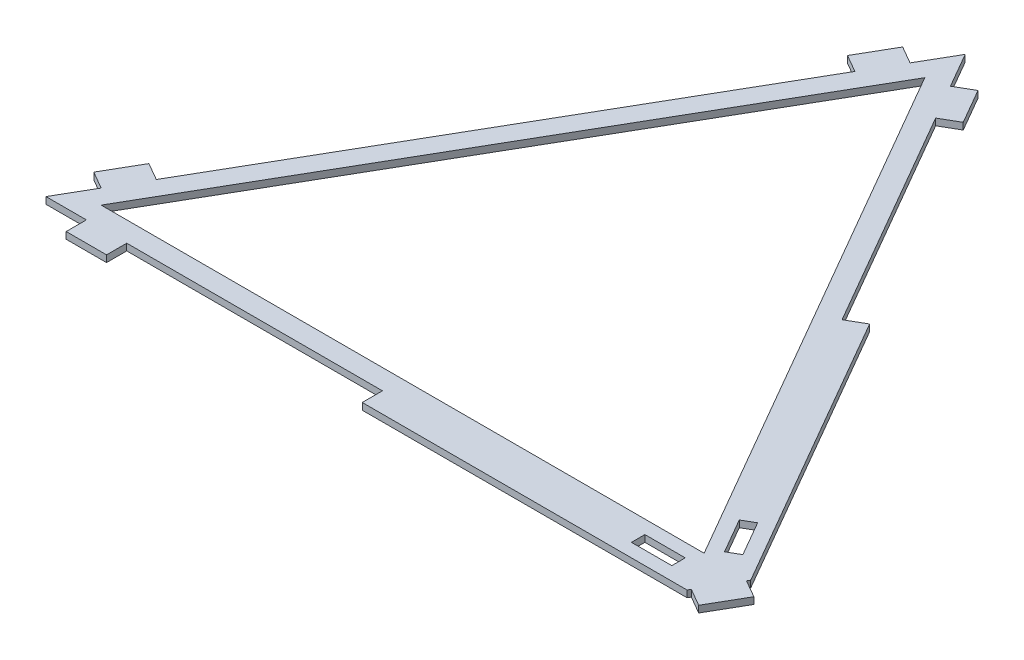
ISO-10303-21;
HEADER;
FILE_DESCRIPTION(('STEP AP214'),'2;1');
FILE_NAME('part.step','',(''),(''),'','','');
FILE_SCHEMA(('AUTOMOTIVE_DESIGN { 1 0 10303 214 1 1 1 1 }'));
ENDSEC;
DATA;
#1=APPLICATION_CONTEXT('core data for automotive mechanical design processes');
#2=APPLICATION_PROTOCOL_DEFINITION('international standard','automotive_design',2000,#1);
#3=PRODUCT_CONTEXT('',#1,'mechanical');
#4=PRODUCT('Part','Part','',(#3));
#5=PRODUCT_RELATED_PRODUCT_CATEGORY('part','',(#4));
#6=PRODUCT_DEFINITION_FORMATION('','',#4);
#7=PRODUCT_DEFINITION_CONTEXT('part definition',#1,'design');
#8=PRODUCT_DEFINITION('design','',#6,#7);
#9=PRODUCT_DEFINITION_SHAPE('','',#8);
#10=(LENGTH_UNIT() NAMED_UNIT(*) SI_UNIT(.MILLI.,.METRE.));
#11=(NAMED_UNIT(*) PLANE_ANGLE_UNIT() SI_UNIT($,.RADIAN.));
#12=(NAMED_UNIT(*) SI_UNIT($,.STERADIAN.) SOLID_ANGLE_UNIT());
#13=UNCERTAINTY_MEASURE_WITH_UNIT(LENGTH_MEASURE(1.E-05),#10,'distance_accuracy_value','');
#14=(GEOMETRIC_REPRESENTATION_CONTEXT(3) GLOBAL_UNCERTAINTY_ASSIGNED_CONTEXT((#13)) GLOBAL_UNIT_ASSIGNED_CONTEXT((#10,
#11,#12)) REPRESENTATION_CONTEXT('',''));
#15=CARTESIAN_POINT('',(0.,0.,0.));
#16=DIRECTION('',(0.,0.,1.));
#17=DIRECTION('',(1.,0.,0.));
#18=AXIS2_PLACEMENT_3D('',#15,#16,#17);
#19=CARTESIAN_POINT('',(0.,5.,-5.00000000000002));
#20=DIRECTION('',(0.,0.,-1.));
#21=DIRECTION('',(-1.,0.,0.));
#22=AXIS2_PLACEMENT_3D('',#19,#20,#21);
#23=PLANE('',#22);
#24=DIRECTION('',(1.,0.,0.));
#25=VECTOR('',#24,1.);
#26=CARTESIAN_POINT('',(0.,0.,-5.00000000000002));
#27=LINE('',#26,#25);
#28=CARTESIAN_POINT('',(440.,0.,-5.00000000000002));
#29=VERTEX_POINT('',#28);
#30=CARTESIAN_POINT('',(470.,0.,-5.00000000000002));
#31=VERTEX_POINT('',#30);
#32=EDGE_CURVE('E416',#29,#31,#27,.T.);
#33=ORIENTED_EDGE('',*,*,#32,.T.);
#34=DIRECTION('',(0.,-1.,0.));
#35=VECTOR('',#34,1.);
#36=CARTESIAN_POINT('',(470.,5.,-5.00000000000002));
#37=LINE('',#36,#35);
#38=CARTESIAN_POINT('',(470.,5.,-5.00000000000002));
#39=VERTEX_POINT('',#38);
#40=EDGE_CURVE('E11',#39,#31,#37,.T.);
#41=ORIENTED_EDGE('',*,*,#40,.F.);
#42=DIRECTION('',(1.,0.,0.));
#43=VECTOR('',#42,1.);
#44=CARTESIAN_POINT('',(0.,5.,-5.00000000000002));
#45=LINE('',#44,#43);
#46=CARTESIAN_POINT('',(440.,5.,-5.00000000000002));
#47=VERTEX_POINT('',#46);
#48=EDGE_CURVE('E300',#47,#39,#45,.T.);
#49=ORIENTED_EDGE('',*,*,#48,.F.);
#50=DIRECTION('',(0.,-1.,0.));
#51=VECTOR('',#50,1.);
#52=CARTESIAN_POINT('',(440.,5.,-5.00000000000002));
#53=LINE('',#52,#51);
#54=EDGE_CURVE('E54',#47,#29,#53,.T.);
#55=ORIENTED_EDGE('',*,*,#54,.T.);
#56=EDGE_LOOP('',(#33,#41,#49,#55));
#57=FACE_BOUND('',#56,.T.);
#58=ADVANCED_FACE('F35',(#57),#23,.F.);
#59=CARTESIAN_POINT('',(470.,5.,0.));
#60=DIRECTION('',(1.,0.,0.));
#61=DIRECTION('',(0.,0.,-1.));
#62=AXIS2_PLACEMENT_3D('',#59,#60,#61);
#63=PLANE('',#62);
#64=DIRECTION('',(0.,0.,1.));
#65=VECTOR('',#64,1.);
#66=CARTESIAN_POINT('',(470.,0.,0.));
#67=LINE('',#66,#65);
#68=CARTESIAN_POINT('',(470.,0.,4.99999999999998));
#69=VERTEX_POINT('',#68);
#70=EDGE_CURVE('E306',#31,#69,#67,.T.);
#71=ORIENTED_EDGE('',*,*,#70,.T.);
#72=DIRECTION('',(0.,-1.,0.));
#73=VECTOR('',#72,1.);
#74=CARTESIAN_POINT('',(470.,5.,4.99999999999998));
#75=LINE('',#74,#73);
#76=CARTESIAN_POINT('',(470.,5.,4.99999999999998));
#77=VERTEX_POINT('',#76);
#78=EDGE_CURVE('E45',#77,#69,#75,.T.);
#79=ORIENTED_EDGE('',*,*,#78,.F.);
#80=DIRECTION('',(0.,0.,1.));
#81=VECTOR('',#80,1.);
#82=CARTESIAN_POINT('',(470.,5.,0.));
#83=LINE('',#82,#81);
#84=EDGE_CURVE('E294',#39,#77,#83,.T.);
#85=ORIENTED_EDGE('',*,*,#84,.F.);
#86=ORIENTED_EDGE('',*,*,#40,.T.);
#87=EDGE_LOOP('',(#71,#79,#85,#86));
#88=FACE_BOUND('',#87,.T.);
#89=ADVANCED_FACE('F305',(#88),#63,.F.);
#90=CARTESIAN_POINT('',(0.,5.,4.99999999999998));
#91=DIRECTION('',(0.,0.,-1.));
#92=DIRECTION('',(-1.,0.,0.));
#93=AXIS2_PLACEMENT_3D('',#90,#91,#92);
#94=PLANE('',#93);
#95=DIRECTION('',(1.,0.,0.));
#96=VECTOR('',#95,1.);
#97=CARTESIAN_POINT('',(0.,0.,4.99999999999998));
#98=LINE('',#97,#96);
#99=CARTESIAN_POINT('',(440.,0.,4.99999999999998));
#100=VERTEX_POINT('',#99);
#101=EDGE_CURVE('E419',#100,#69,#98,.T.);
#102=ORIENTED_EDGE('',*,*,#101,.F.);
#103=DIRECTION('',(0.,-1.,0.));
#104=VECTOR('',#103,1.);
#105=CARTESIAN_POINT('',(440.,5.,4.99999999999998));
#106=LINE('',#105,#104);
#107=CARTESIAN_POINT('',(440.,5.,4.99999999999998));
#108=VERTEX_POINT('',#107);
#109=EDGE_CURVE('E173',#108,#100,#106,.T.);
#110=ORIENTED_EDGE('',*,*,#109,.F.);
#111=DIRECTION('',(1.,0.,0.));
#112=VECTOR('',#111,1.);
#113=CARTESIAN_POINT('',(0.,5.,4.99999999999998));
#114=LINE('',#113,#112);
#115=EDGE_CURVE('E299',#108,#77,#114,.T.);
#116=ORIENTED_EDGE('',*,*,#115,.T.);
#117=ORIENTED_EDGE('',*,*,#78,.T.);
#118=EDGE_LOOP('',(#102,#110,#116,#117));
#119=FACE_BOUND('',#118,.T.);
#120=ADVANCED_FACE('F310',(#119),#94,.T.);
#121=CARTESIAN_POINT('',(12.9903810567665,5.,7.49999999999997));
#122=DIRECTION('',(0.866025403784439,0.,0.5));
#123=DIRECTION('',(0.5,0.,-0.866025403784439));
#124=AXIS2_PLACEMENT_3D('',#121,#122,#123);
#125=PLANE('',#124);
#126=DIRECTION('',(-0.5,0.,0.866025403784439));
#127=VECTOR('',#126,1.);
#128=CARTESIAN_POINT('',(12.9903810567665,0.,7.49999999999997));
#129=LINE('',#128,#127);
#130=CARTESIAN_POINT('',(250.,0.,-403.012701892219));
#131=VERTEX_POINT('',#130);
#132=CARTESIAN_POINT('',(25.9807621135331,0.,-15.));
#133=VERTEX_POINT('',#132);
#134=EDGE_CURVE('E407',#131,#133,#129,.T.);
#135=ORIENTED_EDGE('',*,*,#134,.F.);
#136=DIRECTION('',(0.,-1.,0.));
#137=VECTOR('',#136,1.);
#138=CARTESIAN_POINT('',(250.,5.,-403.012701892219));
#139=LINE('',#138,#137);
#140=CARTESIAN_POINT('',(250.,5.,-403.012701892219));
#141=VERTEX_POINT('',#140);
#142=EDGE_CURVE('E426',#141,#131,#139,.T.);
#143=ORIENTED_EDGE('',*,*,#142,.F.);
#144=DIRECTION('',(-0.5,0.,0.866025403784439));
#145=VECTOR('',#144,1.);
#146=CARTESIAN_POINT('',(12.9903810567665,5.,7.49999999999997));
#147=LINE('',#146,#145);
#148=CARTESIAN_POINT('',(25.9807621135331,5.,-15.));
#149=VERTEX_POINT('',#148);
#150=EDGE_CURVE('E600',#141,#149,#147,.T.);
#151=ORIENTED_EDGE('',*,*,#150,.T.);
#152=DIRECTION('',(0.,-1.,0.));
#153=VECTOR('',#152,1.);
#154=CARTESIAN_POINT('',(25.9807621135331,5.,-15.));
#155=LINE('',#154,#153);
#156=EDGE_CURVE('E428',#149,#133,#155,.T.);
#157=ORIENTED_EDGE('',*,*,#156,.T.);
#158=EDGE_LOOP('',(#135,#143,#151,#157));
#159=FACE_BOUND('',#158,.T.);
#160=ADVANCED_FACE('F622',(#159),#125,.T.);
#161=CARTESIAN_POINT('',(362.009618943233,5.,-209.00635094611));
#162=DIRECTION('',(-0.866025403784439,0.,0.5));
#163=DIRECTION('',(0.5,0.,0.866025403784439));
#164=AXIS2_PLACEMENT_3D('',#161,#162,#163);
#165=PLANE('',#164);
#166=DIRECTION('',(-0.5,0.,-0.866025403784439));
#167=VECTOR('',#166,1.);
#168=CARTESIAN_POINT('',(362.009618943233,0.,-209.00635094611));
#169=LINE('',#168,#167);
#170=CARTESIAN_POINT('',(474.019237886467,0.,-15.));
#171=VERTEX_POINT('',#170);
#172=EDGE_CURVE('E410',#171,#131,#169,.T.);
#173=ORIENTED_EDGE('',*,*,#172,.F.);
#174=DIRECTION('',(0.,-1.,0.));
#175=VECTOR('',#174,1.);
#176=CARTESIAN_POINT('',(474.019237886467,5.,-15.));
#177=LINE('',#176,#175);
#178=CARTESIAN_POINT('',(474.019237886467,5.,-15.));
#179=VERTEX_POINT('',#178);
#180=EDGE_CURVE('E430',#179,#171,#177,.T.);
#181=ORIENTED_EDGE('',*,*,#180,.F.);
#182=DIRECTION('',(-0.5,0.,-0.866025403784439));
#183=VECTOR('',#182,1.);
#184=CARTESIAN_POINT('',(362.009618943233,5.,-209.00635094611));
#185=LINE('',#184,#183);
#186=EDGE_CURVE('E603',#179,#141,#185,.T.);
#187=ORIENTED_EDGE('',*,*,#186,.T.);
#188=ORIENTED_EDGE('',*,*,#142,.T.);
#189=EDGE_LOOP('',(#173,#181,#187,#188));
#190=FACE_BOUND('',#189,.T.);
#191=ADVANCED_FACE('F617',(#190),#165,.T.);
#192=CARTESIAN_POINT('',(370.669872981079,5.,-214.006350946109));
#193=DIRECTION('',(0.86602540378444,0.,-0.499999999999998));
#194=DIRECTION('',(-0.499999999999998,0.,-0.86602540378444));
#195=AXIS2_PLACEMENT_3D('',#192,#193,#194);
#196=PLANE('',#195);
#197=DIRECTION('',(0.499999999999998,0.,0.86602540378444));
#198=VECTOR('',#197,1.);
#199=CARTESIAN_POINT('',(370.669872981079,0.,-214.006350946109));
#200=LINE('',#199,#198);
#201=CARTESIAN_POINT('',(465.669872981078,0.,-49.4615242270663));
#202=VERTEX_POINT('',#201);
#203=CARTESIAN_POINT('',(480.669872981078,0.,-23.4807621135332));
#204=VERTEX_POINT('',#203);
#205=EDGE_CURVE('E395',#202,#204,#200,.T.);
#206=ORIENTED_EDGE('',*,*,#205,.F.);
#207=DIRECTION('',(0.,-1.,0.));
#208=VECTOR('',#207,1.);
#209=CARTESIAN_POINT('',(465.669872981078,5.,-49.4615242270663));
#210=LINE('',#209,#208);
#211=CARTESIAN_POINT('',(465.669872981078,5.,-49.4615242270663));
#212=VERTEX_POINT('',#211);
#213=EDGE_CURVE('E431',#212,#202,#210,.T.);
#214=ORIENTED_EDGE('',*,*,#213,.F.);
#215=DIRECTION('',(0.499999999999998,0.,0.86602540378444));
#216=VECTOR('',#215,1.);
#217=CARTESIAN_POINT('',(370.669872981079,5.,-214.006350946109));
#218=LINE('',#217,#216);
#219=CARTESIAN_POINT('',(480.669872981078,5.,-23.4807621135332));
#220=VERTEX_POINT('',#219);
#221=EDGE_CURVE('E589',#212,#220,#218,.T.);
#222=ORIENTED_EDGE('',*,*,#221,.T.);
#223=DIRECTION('',(0.,-1.,0.));
#224=VECTOR('',#223,1.);
#225=CARTESIAN_POINT('',(480.669872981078,5.,-23.4807621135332));
#226=LINE('',#225,#224);
#227=EDGE_CURVE('E434',#220,#204,#226,.T.);
#228=ORIENTED_EDGE('',*,*,#227,.T.);
#229=EDGE_LOOP('',(#206,#214,#222,#228));
#230=FACE_BOUND('',#229,.T.);
#231=ADVANCED_FACE('F629',(#230),#196,.T.);
#232=CARTESIAN_POINT('',(95.,5.,164.544826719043));
#233=DIRECTION('',(-0.5,0.,-0.866025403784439));
#234=DIRECTION('',(-0.866025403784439,0.,0.5));
#235=AXIS2_PLACEMENT_3D('',#232,#233,#234);
#236=PLANE('',#235);
#237=DIRECTION('',(0.866025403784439,0.,-0.5));
#238=VECTOR('',#237,1.);
#239=CARTESIAN_POINT('',(95.,0.,164.544826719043));
#240=LINE('',#239,#238);
#241=CARTESIAN_POINT('',(474.330127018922,0.,-54.4615242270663));
#242=VERTEX_POINT('',#241);
#243=EDGE_CURVE('E398',#202,#242,#240,.T.);
#244=ORIENTED_EDGE('',*,*,#243,.T.);
#245=DIRECTION('',(0.,-1.,0.));
#246=VECTOR('',#245,1.);
#247=CARTESIAN_POINT('',(474.330127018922,5.,-54.4615242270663));
#248=LINE('',#247,#246);
#249=CARTESIAN_POINT('',(474.330127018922,5.,-54.4615242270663));
#250=VERTEX_POINT('',#249);
#251=EDGE_CURVE('E438',#250,#242,#248,.T.);
#252=ORIENTED_EDGE('',*,*,#251,.F.);
#253=DIRECTION('',(0.866025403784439,0.,-0.5));
#254=VECTOR('',#253,1.);
#255=CARTESIAN_POINT('',(95.,5.,164.544826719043));
#256=LINE('',#255,#254);
#257=EDGE_CURVE('E592',#212,#250,#256,.T.);
#258=ORIENTED_EDGE('',*,*,#257,.F.);
#259=ORIENTED_EDGE('',*,*,#213,.T.);
#260=EDGE_LOOP('',(#244,#252,#258,#259));
#261=FACE_BOUND('',#260,.T.);
#262=ADVANCED_FACE('F755',(#261),#236,.F.);
#263=CARTESIAN_POINT('',(379.330127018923,5.,-219.006350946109));
#264=DIRECTION('',(0.86602540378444,0.,-0.499999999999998));
#265=DIRECTION('',(-0.499999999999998,0.,-0.86602540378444));
#266=AXIS2_PLACEMENT_3D('',#263,#264,#265);
#267=PLANE('',#266);
#268=DIRECTION('',(0.499999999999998,0.,0.86602540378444));
#269=VECTOR('',#268,1.);
#270=CARTESIAN_POINT('',(379.330127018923,0.,-219.006350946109));
#271=LINE('',#270,#269);
#272=CARTESIAN_POINT('',(489.330127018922,0.,-28.4807621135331));
#273=VERTEX_POINT('',#272);
#274=EDGE_CURVE('E401',#242,#273,#271,.T.);
#275=ORIENTED_EDGE('',*,*,#274,.T.);
#276=DIRECTION('',(0.,-1.,0.));
#277=VECTOR('',#276,1.);
#278=CARTESIAN_POINT('',(489.330127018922,5.,-28.4807621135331));
#279=LINE('',#278,#277);
#280=CARTESIAN_POINT('',(489.330127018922,5.,-28.4807621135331));
#281=VERTEX_POINT('',#280);
#282=EDGE_CURVE('E436',#281,#273,#279,.T.);
#283=ORIENTED_EDGE('',*,*,#282,.F.);
#284=DIRECTION('',(0.499999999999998,0.,0.86602540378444));
#285=VECTOR('',#284,1.);
#286=CARTESIAN_POINT('',(379.330127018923,5.,-219.006350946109));
#287=LINE('',#286,#285);
#288=EDGE_CURVE('E595',#250,#281,#287,.T.);
#289=ORIENTED_EDGE('',*,*,#288,.F.);
#290=ORIENTED_EDGE('',*,*,#251,.T.);
#291=EDGE_LOOP('',(#275,#283,#289,#290));
#292=FACE_BOUND('',#291,.T.);
#293=ADVANCED_FACE('F751',(#292),#267,.F.);
#294=CARTESIAN_POINT('',(375.000000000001,5.,216.506350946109));
#295=DIRECTION('',(0.86602540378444,0.,0.499999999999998));
#296=DIRECTION('',(0.499999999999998,0.,-0.86602540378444));
#297=AXIS2_PLACEMENT_3D('',#294,#295,#296);
#298=PLANE('',#297);
#299=DIRECTION('',(-0.499999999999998,0.,0.86602540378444));
#300=VECTOR('',#299,1.);
#301=CARTESIAN_POINT('',(375.000000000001,0.,216.506350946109));
#302=LINE('',#301,#300);
#303=CARTESIAN_POINT('',(492.5,0.,12.9903810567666));
#304=VERTEX_POINT('',#303);
#305=CARTESIAN_POINT('',(491.339745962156,0.,15.));
#306=VERTEX_POINT('',#305);
#307=EDGE_CURVE('E317',#304,#306,#302,.T.);
#308=ORIENTED_EDGE('',*,*,#307,.F.);
#309=DIRECTION('',(0.,-1.,0.));
#310=VECTOR('',#309,1.);
#311=CARTESIAN_POINT('',(492.5,5.,12.9903810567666));
#312=LINE('',#311,#310);
#313=CARTESIAN_POINT('',(492.5,5.,12.9903810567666));
#314=VERTEX_POINT('',#313);
#315=EDGE_CURVE('E39',#314,#304,#312,.T.);
#316=ORIENTED_EDGE('',*,*,#315,.F.);
#317=DIRECTION('',(-0.499999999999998,0.,0.86602540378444));
#318=VECTOR('',#317,1.);
#319=CARTESIAN_POINT('',(375.000000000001,5.,216.506350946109));
#320=LINE('',#319,#318);
#321=CARTESIAN_POINT('',(491.339745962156,5.,15.));
#322=VERTEX_POINT('',#321);
#323=EDGE_CURVE('E424',#314,#322,#320,.T.);
#324=ORIENTED_EDGE('',*,*,#323,.T.);
#325=DIRECTION('',(0.,-1.,0.));
#326=VECTOR('',#325,1.);
#327=CARTESIAN_POINT('',(491.339745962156,5.,15.));
#328=LINE('',#327,#326);
#329=EDGE_CURVE('E313',#322,#306,#328,.T.);
#330=ORIENTED_EDGE('',*,*,#329,.T.);
#331=EDGE_LOOP('',(#308,#316,#324,#330));
#332=FACE_BOUND('',#331,.T.);
#333=ADVANCED_FACE('F37',(#332),#298,.T.);
#334=CARTESIAN_POINT('',(117.5,5.,-203.515969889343));
#335=DIRECTION('',(-0.5,0.,0.866025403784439));
#336=DIRECTION('',(0.866025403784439,0.,0.5));
#337=AXIS2_PLACEMENT_3D('',#334,#335,#336);
#338=PLANE('',#337);
#339=DIRECTION('',(-0.866025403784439,0.,-0.5));
#340=VECTOR('',#339,1.);
#341=CARTESIAN_POINT('',(117.5,0.,-203.515969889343));
#342=LINE('',#341,#340);
#343=CARTESIAN_POINT('',(505.490381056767,0.,20.4903810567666));
#344=VERTEX_POINT('',#343);
#345=EDGE_CURVE('E320',#344,#304,#342,.T.);
#346=ORIENTED_EDGE('',*,*,#345,.F.);
#347=DIRECTION('',(0.,-1.,0.));
#348=VECTOR('',#347,1.);
#349=CARTESIAN_POINT('',(505.490381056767,5.,20.4903810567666));
#350=LINE('',#349,#348);
#351=CARTESIAN_POINT('',(505.490381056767,5.,20.4903810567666));
#352=VERTEX_POINT('',#351);
#353=EDGE_CURVE('E498',#352,#344,#350,.T.);
#354=ORIENTED_EDGE('',*,*,#353,.F.);
#355=DIRECTION('',(-0.866025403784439,0.,-0.5));
#356=VECTOR('',#355,1.);
#357=CARTESIAN_POINT('',(117.5,5.,-203.515969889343));
#358=LINE('',#357,#356);
#359=EDGE_CURVE('E507',#352,#314,#358,.T.);
#360=ORIENTED_EDGE('',*,*,#359,.T.);
#361=ORIENTED_EDGE('',*,*,#315,.T.);
#362=EDGE_LOOP('',(#346,#354,#360,#361));
#363=FACE_BOUND('',#362,.T.);
#364=ADVANCED_FACE('F505',(#363),#338,.T.);
#365=CARTESIAN_POINT('',(387.990381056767,5.,224.00635094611));
#366=DIRECTION('',(0.866025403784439,0.,0.5));
#367=DIRECTION('',(0.5,0.,-0.866025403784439));
#368=AXIS2_PLACEMENT_3D('',#365,#366,#367);
#369=PLANE('',#368);
#370=DIRECTION('',(-0.5,0.,0.866025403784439));
#371=VECTOR('',#370,1.);
#372=CARTESIAN_POINT('',(387.990381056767,0.,224.00635094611));
#373=LINE('',#372,#371);
#374=CARTESIAN_POINT('',(520.490381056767,0.,-5.4903810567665));
#375=VERTEX_POINT('',#374);
#376=EDGE_CURVE('E323',#375,#344,#373,.T.);
#377=ORIENTED_EDGE('',*,*,#376,.F.);
#378=DIRECTION('',(0.,-1.,0.));
#379=VECTOR('',#378,1.);
#380=CARTESIAN_POINT('',(520.490381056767,5.,-5.4903810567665));
#381=LINE('',#380,#379);
#382=CARTESIAN_POINT('',(520.490381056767,5.,-5.4903810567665));
#383=VERTEX_POINT('',#382);
#384=EDGE_CURVE('E497',#383,#375,#381,.T.);
#385=ORIENTED_EDGE('',*,*,#384,.F.);
#386=DIRECTION('',(-0.5,0.,0.866025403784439));
#387=VECTOR('',#386,1.);
#388=CARTESIAN_POINT('',(387.990381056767,5.,224.00635094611));
#389=LINE('',#388,#387);
#390=EDGE_CURVE('E515',#383,#352,#389,.T.);
#391=ORIENTED_EDGE('',*,*,#390,.T.);
#392=ORIENTED_EDGE('',*,*,#353,.T.);
#393=EDGE_LOOP('',(#377,#385,#391,#392));
#394=FACE_BOUND('',#393,.T.);
#395=ADVANCED_FACE('F513',(#394),#369,.T.);
#396=CARTESIAN_POINT('',(132.499999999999,5.,-229.496732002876));
#397=DIRECTION('',(0.499999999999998,0.,-0.86602540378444));
#398=DIRECTION('',(-0.86602540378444,0.,-0.499999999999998));
#399=AXIS2_PLACEMENT_3D('',#396,#397,#398);
#400=PLANE('',#399);
#401=DIRECTION('',(0.86602540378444,0.,0.499999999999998));
#402=VECTOR('',#401,1.);
#403=CARTESIAN_POINT('',(132.499999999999,0.,-229.496732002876));
#404=LINE('',#403,#402);
#405=CARTESIAN_POINT('',(507.5,0.,-12.9903810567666));
#406=VERTEX_POINT('',#405);
#407=EDGE_CURVE('E326',#406,#375,#404,.T.);
#408=ORIENTED_EDGE('',*,*,#407,.F.);
#409=DIRECTION('',(0.,-1.,0.));
#410=VECTOR('',#409,1.);
#411=CARTESIAN_POINT('',(507.5,5.,-12.9903810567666));
#412=LINE('',#411,#410);
#413=CARTESIAN_POINT('',(507.5,5.,-12.9903810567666));
#414=VERTEX_POINT('',#413);
#415=EDGE_CURVE('E495',#414,#406,#412,.T.);
#416=ORIENTED_EDGE('',*,*,#415,.F.);
#417=DIRECTION('',(0.86602540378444,0.,0.499999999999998));
#418=VECTOR('',#417,1.);
#419=CARTESIAN_POINT('',(132.499999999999,5.,-229.496732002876));
#420=LINE('',#419,#418);
#421=EDGE_CURVE('E522',#414,#383,#420,.T.);
#422=ORIENTED_EDGE('',*,*,#421,.T.);
#423=ORIENTED_EDGE('',*,*,#384,.T.);
#424=EDGE_LOOP('',(#408,#416,#422,#423));
#425=FACE_BOUND('',#424,.T.);
#426=ADVANCED_FACE('F525',(#425),#400,.T.);
#427=CARTESIAN_POINT('',(374.999999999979,5.,216.506350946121));
#428=DIRECTION('',(0.866025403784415,0.,0.500000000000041));
#429=DIRECTION('',(0.500000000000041,0.,-0.866025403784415));
#430=AXIS2_PLACEMENT_3D('',#427,#428,#429);
#431=PLANE('',#430);
#432=DIRECTION('',(-0.500000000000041,0.,0.866025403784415));
#433=VECTOR('',#432,1.);
#434=CARTESIAN_POINT('',(374.999999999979,0.,216.506350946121));
#435=LINE('',#434,#433);
#436=CARTESIAN_POINT('',(508.660254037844,0.,-14.9999999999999));
#437=VERTEX_POINT('',#436);
#438=EDGE_CURVE('E329',#437,#406,#435,.T.);
#439=ORIENTED_EDGE('',*,*,#438,.F.);
#440=DIRECTION('',(0.,-1.,0.));
#441=VECTOR('',#440,1.);
#442=CARTESIAN_POINT('',(508.660254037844,5.,-14.9999999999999));
#443=LINE('',#442,#441);
#444=CARTESIAN_POINT('',(508.660254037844,5.,-14.9999999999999));
#445=VERTEX_POINT('',#444);
#446=EDGE_CURVE('E493',#445,#437,#443,.T.);
#447=ORIENTED_EDGE('',*,*,#446,.F.);
#448=DIRECTION('',(-0.500000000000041,0.,0.866025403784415));
#449=VECTOR('',#448,1.);
#450=CARTESIAN_POINT('',(374.999999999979,5.,216.506350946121));
#451=LINE('',#450,#449);
#452=EDGE_CURVE('E526',#445,#414,#451,.T.);
#453=ORIENTED_EDGE('',*,*,#452,.T.);
#454=ORIENTED_EDGE('',*,*,#415,.T.);
#455=EDGE_LOOP('',(#439,#447,#453,#454));
#456=FACE_BOUND('',#455,.T.);
#457=ADVANCED_FACE('F739',(#456),#431,.T.);
#458=CARTESIAN_POINT('',(387.990381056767,5.,-224.00635094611));
#459=DIRECTION('',(-0.866025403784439,0.,0.5));
#460=DIRECTION('',(0.5,0.,0.866025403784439));
#461=AXIS2_PLACEMENT_3D('',#458,#459,#460);
#462=PLANE('',#461);
#463=DIRECTION('',(-0.5,0.,-0.866025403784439));
#464=VECTOR('',#463,1.);
#465=CARTESIAN_POINT('',(387.990381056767,0.,-224.00635094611));
#466=LINE('',#465,#464);
#467=CARTESIAN_POINT('',(387.990381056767,0.,-224.00635094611));
#468=VERTEX_POINT('',#467);
#469=EDGE_CURVE('E332',#437,#468,#466,.T.);
#470=ORIENTED_EDGE('',*,*,#469,.T.);
#471=DIRECTION('',(0.,-1.,0.));
#472=VECTOR('',#471,1.);
#473=CARTESIAN_POINT('',(387.990381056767,5.,-224.00635094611));
#474=LINE('',#473,#472);
#475=CARTESIAN_POINT('',(387.990381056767,5.,-224.00635094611));
#476=VERTEX_POINT('',#475);
#477=EDGE_CURVE('E491',#476,#468,#474,.T.);
#478=ORIENTED_EDGE('',*,*,#477,.F.);
#479=DIRECTION('',(-0.5,0.,-0.866025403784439));
#480=VECTOR('',#479,1.);
#481=CARTESIAN_POINT('',(387.990381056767,5.,-224.00635094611));
#482=LINE('',#481,#480);
#483=EDGE_CURVE('E528',#445,#476,#482,.T.);
#484=ORIENTED_EDGE('',*,*,#483,.F.);
#485=ORIENTED_EDGE('',*,*,#446,.T.);
#486=EDGE_LOOP('',(#470,#478,#484,#485));
#487=FACE_BOUND('',#486,.T.);
#488=ADVANCED_FACE('F735',(#487),#462,.F.);
#489=CARTESIAN_POINT('',(0.,5.,0.));
#490=DIRECTION('',(-0.5,0.,-0.866025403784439));
#491=DIRECTION('',(-0.866025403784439,0.,0.5));
#492=AXIS2_PLACEMENT_3D('',#489,#490,#491);
#493=PLANE('',#492);
#494=DIRECTION('',(0.866025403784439,0.,-0.5));
#495=VECTOR('',#494,1.);
#496=CARTESIAN_POINT('',(0.,0.,0.));
#497=LINE('',#496,#495);
#498=CARTESIAN_POINT('',(375.,0.,-216.50635094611));
#499=VERTEX_POINT('',#498);
#500=EDGE_CURVE('E335',#499,#468,#497,.T.);
#501=ORIENTED_EDGE('',*,*,#500,.F.);
#502=DIRECTION('',(0.,-1.,0.));
#503=VECTOR('',#502,1.);
#504=CARTESIAN_POINT('',(375.,5.,-216.50635094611));
#505=LINE('',#504,#503);
#506=CARTESIAN_POINT('',(375.,5.,-216.50635094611));
#507=VERTEX_POINT('',#506);
#508=EDGE_CURVE('E489',#507,#499,#505,.T.);
#509=ORIENTED_EDGE('',*,*,#508,.F.);
#510=DIRECTION('',(0.866025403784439,0.,-0.5));
#511=VECTOR('',#510,1.);
#512=CARTESIAN_POINT('',(0.,5.,0.));
#513=LINE('',#512,#511);
#514=EDGE_CURVE('E533',#507,#476,#513,.T.);
#515=ORIENTED_EDGE('',*,*,#514,.T.);
#516=ORIENTED_EDGE('',*,*,#477,.T.);
#517=EDGE_LOOP('',(#501,#509,#515,#516));
#518=FACE_BOUND('',#517,.T.);
#519=ADVANCED_FACE('F731',(#518),#493,.T.);
#520=CARTESIAN_POINT('',(375.,5.,-216.50635094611));
#521=DIRECTION('',(-0.866025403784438,0.,0.500000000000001));
#522=DIRECTION('',(0.500000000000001,0.,0.866025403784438));
#523=AXIS2_PLACEMENT_3D('',#520,#521,#522);
#524=PLANE('',#523);
#525=DIRECTION('',(-0.500000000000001,0.,-0.866025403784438));
#526=VECTOR('',#525,1.);
#527=CARTESIAN_POINT('',(375.,0.,-216.50635094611));
#528=LINE('',#527,#526);
#529=CARTESIAN_POINT('',(280.,0.,-381.051177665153));
#530=VERTEX_POINT('',#529);
#531=EDGE_CURVE('E338',#499,#530,#528,.T.);
#532=ORIENTED_EDGE('',*,*,#531,.T.);
#533=DIRECTION('',(0.,-1.,0.));
#534=VECTOR('',#533,1.);
#535=CARTESIAN_POINT('',(280.,5.,-381.051177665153));
#536=LINE('',#535,#534);
#537=CARTESIAN_POINT('',(280.,5.,-381.051177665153));
#538=VERTEX_POINT('',#537);
#539=EDGE_CURVE('E487',#538,#530,#536,.T.);
#540=ORIENTED_EDGE('',*,*,#539,.F.);
#541=DIRECTION('',(-0.500000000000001,0.,-0.866025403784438));
#542=VECTOR('',#541,1.);
#543=CARTESIAN_POINT('',(375.,5.,-216.50635094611));
#544=LINE('',#543,#542);
#545=EDGE_CURVE('E536',#507,#538,#544,.T.);
#546=ORIENTED_EDGE('',*,*,#545,.F.);
#547=ORIENTED_EDGE('',*,*,#508,.T.);
#548=EDGE_LOOP('',(#532,#540,#546,#547));
#549=FACE_BOUND('',#548,.T.);
#550=ADVANCED_FACE('F727',(#549),#524,.F.);
#551=CARTESIAN_POINT('',(-95.0000000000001,5.,-164.544826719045));
#552=DIRECTION('',(0.499999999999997,0.,0.86602540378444));
#553=DIRECTION('',(0.86602540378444,0.,-0.499999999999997));
#554=AXIS2_PLACEMENT_3D('',#551,#552,#553);
#555=PLANE('',#554);
#556=DIRECTION('',(-0.86602540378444,0.,0.499999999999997));
#557=VECTOR('',#556,1.);
#558=CARTESIAN_POINT('',(-95.0000000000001,0.,-164.544826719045));
#559=LINE('',#558,#557);
#560=CARTESIAN_POINT('',(292.990381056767,0.,-388.551177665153));
#561=VERTEX_POINT('',#560);
#562=EDGE_CURVE('E341',#561,#530,#559,.T.);
#563=ORIENTED_EDGE('',*,*,#562,.F.);
#564=DIRECTION('',(0.,-1.,0.));
#565=VECTOR('',#564,1.);
#566=CARTESIAN_POINT('',(292.990381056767,5.,-388.551177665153));
#567=LINE('',#566,#565);
#568=CARTESIAN_POINT('',(292.990381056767,5.,-388.551177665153));
#569=VERTEX_POINT('',#568);
#570=EDGE_CURVE('E485',#569,#561,#567,.T.);
#571=ORIENTED_EDGE('',*,*,#570,.F.);
#572=DIRECTION('',(-0.86602540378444,0.,0.499999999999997));
#573=VECTOR('',#572,1.);
#574=CARTESIAN_POINT('',(-95.0000000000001,5.,-164.544826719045));
#575=LINE('',#574,#573);
#576=EDGE_CURVE('E538',#569,#538,#575,.T.);
#577=ORIENTED_EDGE('',*,*,#576,.T.);
#578=ORIENTED_EDGE('',*,*,#539,.T.);
#579=EDGE_LOOP('',(#563,#571,#577,#578));
#580=FACE_BOUND('',#579,.T.);
#581=ADVANCED_FACE('F723',(#580),#555,.T.);
#582=CARTESIAN_POINT('',(387.990381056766,5.,-224.006350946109));
#583=DIRECTION('',(0.866025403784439,0.,-0.499999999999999));
#584=DIRECTION('',(-0.499999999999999,0.,-0.866025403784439));
#585=AXIS2_PLACEMENT_3D('',#582,#583,#584);
#586=PLANE('',#585);
#587=DIRECTION('',(0.499999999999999,0.,0.866025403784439));
#588=VECTOR('',#587,1.);
#589=CARTESIAN_POINT('',(387.990381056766,0.,-224.006350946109));
#590=LINE('',#589,#588);
#591=CARTESIAN_POINT('',(277.990381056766,0.,-414.531939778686));
#592=VERTEX_POINT('',#591);
#593=EDGE_CURVE('E344',#592,#561,#590,.T.);
#594=ORIENTED_EDGE('',*,*,#593,.F.);
#595=DIRECTION('',(0.,-1.,0.));
#596=VECTOR('',#595,1.);
#597=CARTESIAN_POINT('',(277.990381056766,5.,-414.531939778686));
#598=LINE('',#597,#596);
#599=CARTESIAN_POINT('',(277.990381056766,5.,-414.531939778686));
#600=VERTEX_POINT('',#599);
#601=EDGE_CURVE('E483',#600,#592,#598,.T.);
#602=ORIENTED_EDGE('',*,*,#601,.F.);
#603=DIRECTION('',(0.499999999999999,0.,0.866025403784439));
#604=VECTOR('',#603,1.);
#605=CARTESIAN_POINT('',(387.990381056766,5.,-224.006350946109));
#606=LINE('',#605,#604);
#607=EDGE_CURVE('E541',#600,#569,#606,.T.);
#608=ORIENTED_EDGE('',*,*,#607,.T.);
#609=ORIENTED_EDGE('',*,*,#570,.T.);
#610=EDGE_LOOP('',(#594,#602,#608,#609));
#611=FACE_BOUND('',#610,.T.);
#612=ADVANCED_FACE('F719',(#611),#586,.T.);
#613=CARTESIAN_POINT('',(-110.,5.,-190.525588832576));
#614=DIRECTION('',(-0.5,0.,-0.866025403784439));
#615=DIRECTION('',(-0.866025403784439,0.,0.5));
#616=AXIS2_PLACEMENT_3D('',#613,#614,#615);
#617=PLANE('',#616);
#618=DIRECTION('',(0.866025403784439,0.,-0.5));
#619=VECTOR('',#618,1.);
#620=CARTESIAN_POINT('',(-110.,0.,-190.525588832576));
#621=LINE('',#620,#619);
#622=CARTESIAN_POINT('',(265.,0.,-407.031939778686));
#623=VERTEX_POINT('',#622);
#624=EDGE_CURVE('E347',#623,#592,#621,.T.);
#625=ORIENTED_EDGE('',*,*,#624,.F.);
#626=DIRECTION('',(0.,-1.,0.));
#627=VECTOR('',#626,1.);
#628=CARTESIAN_POINT('',(265.,5.,-407.031939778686));
#629=LINE('',#628,#627);
#630=CARTESIAN_POINT('',(265.,5.,-407.031939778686));
#631=VERTEX_POINT('',#630);
#632=EDGE_CURVE('E481',#631,#623,#629,.T.);
#633=ORIENTED_EDGE('',*,*,#632,.F.);
#634=DIRECTION('',(0.866025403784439,0.,-0.5));
#635=VECTOR('',#634,1.);
#636=CARTESIAN_POINT('',(-110.,5.,-190.525588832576));
#637=LINE('',#636,#635);
#638=EDGE_CURVE('E544',#631,#600,#637,.T.);
#639=ORIENTED_EDGE('',*,*,#638,.T.);
#640=ORIENTED_EDGE('',*,*,#601,.T.);
#641=EDGE_LOOP('',(#625,#633,#639,#640));
#642=FACE_BOUND('',#641,.T.);
#643=ADVANCED_FACE('F715',(#642),#617,.T.);
#644=CARTESIAN_POINT('',(375.,5.,-216.506350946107));
#645=DIRECTION('',(0.866025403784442,0.,-0.499999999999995));
#646=DIRECTION('',(-0.499999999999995,0.,-0.866025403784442));
#647=AXIS2_PLACEMENT_3D('',#644,#645,#646);
#648=PLANE('',#647);
#649=DIRECTION('',(0.499999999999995,0.,0.866025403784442));
#650=VECTOR('',#649,1.);
#651=CARTESIAN_POINT('',(375.,0.,-216.506350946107));
#652=LINE('',#651,#650);
#653=CARTESIAN_POINT('',(250.,0.,-433.012701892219));
#654=VERTEX_POINT('',#653);
#655=EDGE_CURVE('E350',#654,#623,#652,.T.);
#656=ORIENTED_EDGE('',*,*,#655,.F.);
#657=DIRECTION('',(0.,-1.,0.));
#658=VECTOR('',#657,1.);
#659=CARTESIAN_POINT('',(250.,5.,-433.012701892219));
#660=LINE('',#659,#658);
#661=CARTESIAN_POINT('',(250.,5.,-433.012701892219));
#662=VERTEX_POINT('',#661);
#663=EDGE_CURVE('E479',#662,#654,#660,.T.);
#664=ORIENTED_EDGE('',*,*,#663,.F.);
#665=DIRECTION('',(0.499999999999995,0.,0.866025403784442));
#666=VECTOR('',#665,1.);
#667=CARTESIAN_POINT('',(375.,5.,-216.506350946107));
#668=LINE('',#667,#666);
#669=EDGE_CURVE('E547',#662,#631,#668,.T.);
#670=ORIENTED_EDGE('',*,*,#669,.T.);
#671=ORIENTED_EDGE('',*,*,#632,.T.);
#672=EDGE_LOOP('',(#656,#664,#670,#671));
#673=FACE_BOUND('',#672,.T.);
#674=ADVANCED_FACE('F711',(#673),#648,.T.);
#675=CARTESIAN_POINT('',(1.41818498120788E-12,5.,8.18789480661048E-13));
#676=DIRECTION('',(0.86602540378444,0.,0.499999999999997));
#677=DIRECTION('',(0.499999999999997,0.,-0.86602540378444));
#678=AXIS2_PLACEMENT_3D('',#675,#676,#677);
#679=PLANE('',#678);
#680=DIRECTION('',(-0.499999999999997,0.,0.86602540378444));
#681=VECTOR('',#680,1.);
#682=CARTESIAN_POINT('',(1.41818498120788E-12,0.,8.18789480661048E-13));
#683=LINE('',#682,#681);
#684=CARTESIAN_POINT('',(235.,0.,-407.031939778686));
#685=VERTEX_POINT('',#684);
#686=EDGE_CURVE('E353',#654,#685,#683,.T.);
#687=ORIENTED_EDGE('',*,*,#686,.T.);
#688=DIRECTION('',(0.,-1.,0.));
#689=VECTOR('',#688,1.);
#690=CARTESIAN_POINT('',(235.,5.,-407.031939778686));
#691=LINE('',#690,#689);
#692=CARTESIAN_POINT('',(235.,5.,-407.031939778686));
#693=VERTEX_POINT('',#692);
#694=EDGE_CURVE('E476',#693,#685,#691,.T.);
#695=ORIENTED_EDGE('',*,*,#694,.F.);
#696=DIRECTION('',(-0.499999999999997,0.,0.86602540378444));
#697=VECTOR('',#696,1.);
#698=CARTESIAN_POINT('',(1.41818498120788E-12,5.,8.18789480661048E-13));
#699=LINE('',#698,#697);
#700=EDGE_CURVE('E550',#662,#693,#699,.T.);
#701=ORIENTED_EDGE('',*,*,#700,.F.);
#702=ORIENTED_EDGE('',*,*,#663,.T.);
#703=EDGE_LOOP('',(#687,#695,#701,#702));
#704=FACE_BOUND('',#703,.T.);
#705=ADVANCED_FACE('F707',(#704),#679,.F.);
#706=CARTESIAN_POINT('',(235.,5.,-407.031939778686));
#707=DIRECTION('',(-0.5,0.,0.866025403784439));
#708=DIRECTION('',(0.866025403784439,0.,0.5));
#709=AXIS2_PLACEMENT_3D('',#706,#707,#708);
#710=PLANE('',#709);
#711=DIRECTION('',(-0.866025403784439,0.,-0.5));
#712=VECTOR('',#711,1.);
#713=CARTESIAN_POINT('',(235.,0.,-407.031939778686));
#714=LINE('',#713,#712);
#715=CARTESIAN_POINT('',(222.009618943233,0.,-414.531939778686));
#716=VERTEX_POINT('',#715);
#717=EDGE_CURVE('E355',#685,#716,#714,.T.);
#718=ORIENTED_EDGE('',*,*,#717,.T.);
#719=DIRECTION('',(0.,-1.,0.));
#720=VECTOR('',#719,1.);
#721=CARTESIAN_POINT('',(222.009618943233,5.,-414.531939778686));
#722=LINE('',#721,#720);
#723=CARTESIAN_POINT('',(222.009618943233,5.,-414.531939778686));
#724=VERTEX_POINT('',#723);
#725=EDGE_CURVE('E473',#724,#716,#722,.T.);
#726=ORIENTED_EDGE('',*,*,#725,.F.);
#727=DIRECTION('',(-0.866025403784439,0.,-0.5));
#728=VECTOR('',#727,1.);
#729=CARTESIAN_POINT('',(235.,5.,-407.031939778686));
#730=LINE('',#729,#728);
#731=EDGE_CURVE('E552',#693,#724,#730,.T.);
#732=ORIENTED_EDGE('',*,*,#731,.F.);
#733=ORIENTED_EDGE('',*,*,#694,.T.);
#734=EDGE_LOOP('',(#718,#726,#732,#733));
#735=FACE_BOUND('',#734,.T.);
#736=ADVANCED_FACE('F703',(#735),#710,.F.);
#737=CARTESIAN_POINT('',(-12.9903810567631,5.,-7.49999999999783));
#738=DIRECTION('',(0.866025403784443,0.,0.499999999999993));
#739=DIRECTION('',(0.499999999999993,0.,-0.866025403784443));
#740=AXIS2_PLACEMENT_3D('',#737,#738,#739);
#741=PLANE('',#740);
#742=DIRECTION('',(-0.499999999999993,0.,0.866025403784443));
#743=VECTOR('',#742,1.);
#744=CARTESIAN_POINT('',(-12.9903810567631,0.,-7.49999999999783));
#745=LINE('',#744,#743);
#746=CARTESIAN_POINT('',(207.009618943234,0.,-388.551177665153));
#747=VERTEX_POINT('',#746);
#748=EDGE_CURVE('E357',#716,#747,#745,.T.);
#749=ORIENTED_EDGE('',*,*,#748,.T.);
#750=DIRECTION('',(0.,-1.,0.));
#751=VECTOR('',#750,1.);
#752=CARTESIAN_POINT('',(207.009618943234,5.,-388.551177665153));
#753=LINE('',#752,#751);
#754=CARTESIAN_POINT('',(207.009618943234,5.,-388.551177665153));
#755=VERTEX_POINT('',#754);
#756=EDGE_CURVE('E470',#755,#747,#753,.T.);
#757=ORIENTED_EDGE('',*,*,#756,.F.);
#758=DIRECTION('',(-0.499999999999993,0.,0.866025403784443));
#759=VECTOR('',#758,1.);
#760=CARTESIAN_POINT('',(-12.9903810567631,5.,-7.49999999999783));
#761=LINE('',#760,#759);
#762=EDGE_CURVE('E554',#724,#755,#761,.T.);
#763=ORIENTED_EDGE('',*,*,#762,.F.);
#764=ORIENTED_EDGE('',*,*,#725,.T.);
#765=EDGE_LOOP('',(#749,#757,#763,#764));
#766=FACE_BOUND('',#765,.T.);
#767=ADVANCED_FACE('F699',(#766),#741,.F.);
#768=CARTESIAN_POINT('',(220.,5.,-381.051177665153));
#769=DIRECTION('',(0.499999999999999,0.,-0.866025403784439));
#770=DIRECTION('',(-0.866025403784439,0.,-0.499999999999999));
#771=AXIS2_PLACEMENT_3D('',#768,#769,#770);
#772=PLANE('',#771);
#773=DIRECTION('',(0.866025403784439,0.,0.499999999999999));
#774=VECTOR('',#773,1.);
#775=CARTESIAN_POINT('',(220.,0.,-381.051177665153));
#776=LINE('',#775,#774);
#777=CARTESIAN_POINT('',(220.,0.,-381.051177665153));
#778=VERTEX_POINT('',#777);
#779=EDGE_CURVE('E359',#747,#778,#776,.T.);
#780=ORIENTED_EDGE('',*,*,#779,.T.);
#781=DIRECTION('',(0.,-1.,0.));
#782=VECTOR('',#781,1.);
#783=CARTESIAN_POINT('',(220.,5.,-381.051177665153));
#784=LINE('',#783,#782);
#785=CARTESIAN_POINT('',(220.,5.,-381.051177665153));
#786=VERTEX_POINT('',#785);
#787=EDGE_CURVE('E468',#786,#778,#784,.T.);
#788=ORIENTED_EDGE('',*,*,#787,.F.);
#789=DIRECTION('',(0.866025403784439,0.,0.499999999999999));
#790=VECTOR('',#789,1.);
#791=CARTESIAN_POINT('',(220.,5.,-381.051177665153));
#792=LINE('',#791,#790);
#793=EDGE_CURVE('E556',#755,#786,#792,.T.);
#794=ORIENTED_EDGE('',*,*,#793,.F.);
#795=ORIENTED_EDGE('',*,*,#756,.T.);
#796=EDGE_LOOP('',(#780,#788,#794,#795));
#797=FACE_BOUND('',#796,.T.);
#798=ADVANCED_FACE('F695',(#797),#772,.F.);
#799=CARTESIAN_POINT('',(1.95300897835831E-13,5.,1.12757025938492E-13));
#800=DIRECTION('',(-0.866025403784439,0.,-0.5));
#801=DIRECTION('',(-0.5,0.,0.866025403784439));
#802=AXIS2_PLACEMENT_3D('',#799,#800,#801);
#803=PLANE('',#802);
#804=DIRECTION('',(0.5,0.,-0.866025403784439));
#805=VECTOR('',#804,1.);
#806=CARTESIAN_POINT('',(1.95300897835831E-13,0.,1.12757025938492E-13));
#807=LINE('',#806,#805);
#808=CARTESIAN_POINT('',(30.0000000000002,0.,-51.9615242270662));
#809=VERTEX_POINT('',#808);
#810=EDGE_CURVE('E362',#809,#778,#807,.T.);
#811=ORIENTED_EDGE('',*,*,#810,.F.);
#812=DIRECTION('',(0.,-1.,0.));
#813=VECTOR('',#812,1.);
#814=CARTESIAN_POINT('',(30.0000000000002,5.,-51.9615242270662));
#815=LINE('',#814,#813);
#816=CARTESIAN_POINT('',(30.0000000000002,5.,-51.9615242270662));
#817=VERTEX_POINT('',#816);
#818=EDGE_CURVE('E466',#817,#809,#815,.T.);
#819=ORIENTED_EDGE('',*,*,#818,.F.);
#820=DIRECTION('',(0.5,0.,-0.866025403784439));
#821=VECTOR('',#820,1.);
#822=CARTESIAN_POINT('',(1.95300897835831E-13,5.,1.12757025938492E-13));
#823=LINE('',#822,#821);
#824=EDGE_CURVE('E558',#817,#786,#823,.T.);
#825=ORIENTED_EDGE('',*,*,#824,.T.);
#826=ORIENTED_EDGE('',*,*,#787,.T.);
#827=EDGE_LOOP('',(#811,#819,#825,#826));
#828=FACE_BOUND('',#827,.T.);
#829=ADVANCED_FACE('F691',(#828),#803,.T.);
#830=CARTESIAN_POINT('',(30.0000000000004,5.,-51.9615242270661));
#831=DIRECTION('',(0.500000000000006,0.,-0.866025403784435));
#832=DIRECTION('',(-0.866025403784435,0.,-0.500000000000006));
#833=AXIS2_PLACEMENT_3D('',#830,#831,#832);
#834=PLANE('',#833);
#835=DIRECTION('',(0.866025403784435,0.,0.500000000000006));
#836=VECTOR('',#835,1.);
#837=CARTESIAN_POINT('',(30.0000000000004,0.,-51.9615242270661));
#838=LINE('',#837,#836);
#839=CARTESIAN_POINT('',(17.0096189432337,0.,-59.4615242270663));
#840=VERTEX_POINT('',#839);
#841=EDGE_CURVE('E365',#840,#809,#838,.T.);
#842=ORIENTED_EDGE('',*,*,#841,.F.);
#843=DIRECTION('',(0.,-1.,0.));
#844=VECTOR('',#843,1.);
#845=CARTESIAN_POINT('',(17.0096189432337,5.,-59.4615242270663));
#846=LINE('',#845,#844);
#847=CARTESIAN_POINT('',(17.0096189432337,5.,-59.4615242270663));
#848=VERTEX_POINT('',#847);
#849=EDGE_CURVE('E464',#848,#840,#846,.T.);
#850=ORIENTED_EDGE('',*,*,#849,.F.);
#851=DIRECTION('',(0.866025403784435,0.,0.500000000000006));
#852=VECTOR('',#851,1.);
#853=CARTESIAN_POINT('',(30.0000000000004,5.,-51.9615242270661));
#854=LINE('',#853,#852);
#855=EDGE_CURVE('E561',#848,#817,#854,.T.);
#856=ORIENTED_EDGE('',*,*,#855,.T.);
#857=ORIENTED_EDGE('',*,*,#818,.T.);
#858=EDGE_LOOP('',(#842,#850,#856,#857));
#859=FACE_BOUND('',#858,.T.);
#860=ADVANCED_FACE('F687',(#859),#834,.T.);
#861=CARTESIAN_POINT('',(-12.9903810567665,5.,-7.50000000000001));
#862=DIRECTION('',(-0.866025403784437,0.,-0.500000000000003));
#863=DIRECTION('',(-0.500000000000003,0.,0.866025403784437));
#864=AXIS2_PLACEMENT_3D('',#861,#862,#863);
#865=PLANE('',#864);
#866=DIRECTION('',(0.500000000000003,0.,-0.866025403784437));
#867=VECTOR('',#866,1.);
#868=CARTESIAN_POINT('',(-12.9903810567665,0.,-7.50000000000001));
#869=LINE('',#868,#867);
#870=CARTESIAN_POINT('',(2.00961894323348,0.,-33.4807621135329));
#871=VERTEX_POINT('',#870);
#872=EDGE_CURVE('E368',#871,#840,#869,.T.);
#873=ORIENTED_EDGE('',*,*,#872,.F.);
#874=DIRECTION('',(0.,-1.,0.));
#875=VECTOR('',#874,1.);
#876=CARTESIAN_POINT('',(2.00961894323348,5.,-33.4807621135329));
#877=LINE('',#876,#875);
#878=CARTESIAN_POINT('',(2.00961894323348,5.,-33.4807621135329));
#879=VERTEX_POINT('',#878);
#880=EDGE_CURVE('E462',#879,#871,#877,.T.);
#881=ORIENTED_EDGE('',*,*,#880,.F.);
#882=DIRECTION('',(0.500000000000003,0.,-0.866025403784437));
#883=VECTOR('',#882,1.);
#884=CARTESIAN_POINT('',(-12.9903810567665,5.,-7.50000000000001));
#885=LINE('',#884,#883);
#886=EDGE_CURVE('E564',#879,#848,#885,.T.);
#887=ORIENTED_EDGE('',*,*,#886,.T.);
#888=ORIENTED_EDGE('',*,*,#849,.T.);
#889=EDGE_LOOP('',(#873,#881,#887,#888));
#890=FACE_BOUND('',#889,.T.);
#891=ADVANCED_FACE('F683',(#890),#865,.T.);
#892=CARTESIAN_POINT('',(14.9999999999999,5.,-25.980762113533));
#893=DIRECTION('',(-0.5,0.,0.866025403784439));
#894=DIRECTION('',(0.866025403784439,0.,0.5));
#895=AXIS2_PLACEMENT_3D('',#892,#893,#894);
#896=PLANE('',#895);
#897=DIRECTION('',(-0.866025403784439,0.,-0.5));
#898=VECTOR('',#897,1.);
#899=CARTESIAN_POINT('',(14.9999999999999,0.,-25.980762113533));
#900=LINE('',#899,#898);
#901=CARTESIAN_POINT('',(15.0000000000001,0.,-25.9807621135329));
#902=VERTEX_POINT('',#901);
#903=EDGE_CURVE('E371',#902,#871,#900,.T.);
#904=ORIENTED_EDGE('',*,*,#903,.F.);
#905=DIRECTION('',(0.,-1.,0.));
#906=VECTOR('',#905,1.);
#907=CARTESIAN_POINT('',(15.0000000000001,5.,-25.9807621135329));
#908=LINE('',#907,#906);
#909=CARTESIAN_POINT('',(15.0000000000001,5.,-25.9807621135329));
#910=VERTEX_POINT('',#909);
#911=EDGE_CURVE('E460',#910,#902,#908,.T.);
#912=ORIENTED_EDGE('',*,*,#911,.F.);
#913=DIRECTION('',(-0.866025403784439,0.,-0.5));
#914=VECTOR('',#913,1.);
#915=CARTESIAN_POINT('',(14.9999999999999,5.,-25.980762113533));
#916=LINE('',#915,#914);
#917=EDGE_CURVE('E567',#910,#879,#916,.T.);
#918=ORIENTED_EDGE('',*,*,#917,.T.);
#919=ORIENTED_EDGE('',*,*,#880,.T.);
#920=EDGE_LOOP('',(#904,#912,#918,#919));
#921=FACE_BOUND('',#920,.T.);
#922=ADVANCED_FACE('F679',(#921),#896,.T.);
#923=CARTESIAN_POINT('',(0.,5.,0.));
#924=DIRECTION('',(-0.866025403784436,0.,-0.500000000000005));
#925=DIRECTION('',(-0.500000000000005,0.,0.866025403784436));
#926=AXIS2_PLACEMENT_3D('',#923,#924,#925);
#927=PLANE('',#926);
#928=DIRECTION('',(0.500000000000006,0.,-0.866025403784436));
#929=VECTOR('',#928,1.);
#930=CARTESIAN_POINT('',(0.,0.,0.));
#931=LINE('',#930,#929);
#932=CARTESIAN_POINT('',(0.,0.,0.));
#933=VERTEX_POINT('',#932);
#934=EDGE_CURVE('E374',#933,#902,#931,.T.);
#935=ORIENTED_EDGE('',*,*,#934,.F.);
#936=DIRECTION('',(0.,-1.,0.));
#937=VECTOR('',#936,1.);
#938=CARTESIAN_POINT('',(0.,5.,0.));
#939=LINE('',#938,#937);
#940=CARTESIAN_POINT('',(0.,5.,0.));
#941=VERTEX_POINT('',#940);
#942=EDGE_CURVE('E458',#941,#933,#939,.T.);
#943=ORIENTED_EDGE('',*,*,#942,.F.);
#944=DIRECTION('',(0.500000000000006,0.,-0.866025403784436));
#945=VECTOR('',#944,1.);
#946=CARTESIAN_POINT('',(0.,5.,0.));
#947=LINE('',#946,#945);
#948=EDGE_CURVE('E570',#941,#910,#947,.T.);
#949=ORIENTED_EDGE('',*,*,#948,.T.);
#950=ORIENTED_EDGE('',*,*,#911,.T.);
#951=EDGE_LOOP('',(#935,#943,#949,#950));
#952=FACE_BOUND('',#951,.T.);
#953=ADVANCED_FACE('F675',(#952),#927,.T.);
#954=CARTESIAN_POINT('',(0.,5.,0.));
#955=DIRECTION('',(0.,0.,-1.));
#956=DIRECTION('',(-1.,0.,0.));
#957=AXIS2_PLACEMENT_3D('',#954,#955,#956);
#958=PLANE('',#957);
#959=DIRECTION('',(1.,0.,0.));
#960=VECTOR('',#959,1.);
#961=CARTESIAN_POINT('',(0.,0.,0.));
#962=LINE('',#961,#960);
#963=CARTESIAN_POINT('',(30.,0.,1.11022302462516E-13));
#964=VERTEX_POINT('',#963);
#965=EDGE_CURVE('E377',#933,#964,#962,.T.);
#966=ORIENTED_EDGE('',*,*,#965,.T.);
#967=DIRECTION('',(0.,-1.,0.));
#968=VECTOR('',#967,1.);
#969=CARTESIAN_POINT('',(30.,5.,1.11022302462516E-13));
#970=LINE('',#969,#968);
#971=CARTESIAN_POINT('',(30.,5.,1.11022302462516E-13));
#972=VERTEX_POINT('',#971);
#973=EDGE_CURVE('E455',#972,#964,#970,.T.);
#974=ORIENTED_EDGE('',*,*,#973,.F.);
#975=DIRECTION('',(1.,0.,0.));
#976=VECTOR('',#975,1.);
#977=CARTESIAN_POINT('',(0.,5.,0.));
#978=LINE('',#977,#976);
#979=EDGE_CURVE('E573',#941,#972,#978,.T.);
#980=ORIENTED_EDGE('',*,*,#979,.F.);
#981=ORIENTED_EDGE('',*,*,#942,.T.);
#982=EDGE_LOOP('',(#966,#974,#980,#981));
#983=FACE_BOUND('',#982,.T.);
#984=ADVANCED_FACE('F671',(#983),#958,.F.);
#985=CARTESIAN_POINT('',(30.,5.,-3.33066907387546E-13));
#986=DIRECTION('',(1.,0.,0.));
#987=DIRECTION('',(0.,0.,-1.));
#988=AXIS2_PLACEMENT_3D('',#985,#986,#987);
#989=PLANE('',#988);
#990=DIRECTION('',(0.,0.,1.));
#991=VECTOR('',#990,1.);
#992=CARTESIAN_POINT('',(30.,0.,-3.33066907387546E-13));
#993=LINE('',#992,#991);
#994=CARTESIAN_POINT('',(30.0000000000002,0.,15.0000000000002));
#995=VERTEX_POINT('',#994);
#996=EDGE_CURVE('E379',#964,#995,#993,.T.);
#997=ORIENTED_EDGE('',*,*,#996,.T.);
#998=DIRECTION('',(0.,-1.,0.));
#999=VECTOR('',#998,1.);
#1000=CARTESIAN_POINT('',(30.0000000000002,5.,15.0000000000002));
#1001=LINE('',#1000,#999);
#1002=CARTESIAN_POINT('',(30.0000000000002,5.,15.0000000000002));
#1003=VERTEX_POINT('',#1002);
#1004=EDGE_CURVE('E452',#1003,#995,#1001,.T.);
#1005=ORIENTED_EDGE('',*,*,#1004,.F.);
#1006=DIRECTION('',(0.,0.,1.));
#1007=VECTOR('',#1006,1.);
#1008=CARTESIAN_POINT('',(30.,5.,-3.33066907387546E-13));
#1009=LINE('',#1008,#1007);
#1010=EDGE_CURVE('E575',#972,#1003,#1009,.T.);
#1011=ORIENTED_EDGE('',*,*,#1010,.F.);
#1012=ORIENTED_EDGE('',*,*,#973,.T.);
#1013=EDGE_LOOP('',(#997,#1005,#1011,#1012));
#1014=FACE_BOUND('',#1013,.T.);
#1015=ADVANCED_FACE('F667',(#1014),#989,.F.);
#1016=CARTESIAN_POINT('',(1.66533453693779E-13,5.,15.0000000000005));
#1017=DIRECTION('',(0.,0.,-1.));
#1018=DIRECTION('',(-1.,0.,0.));
#1019=AXIS2_PLACEMENT_3D('',#1016,#1017,#1018);
#1020=PLANE('',#1019);
#1021=DIRECTION('',(1.,0.,0.));
#1022=VECTOR('',#1021,1.);
#1023=CARTESIAN_POINT('',(1.66533453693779E-13,0.,15.0000000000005));
#1024=LINE('',#1023,#1022);
#1025=CARTESIAN_POINT('',(60.0000000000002,0.,14.9999999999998));
#1026=VERTEX_POINT('',#1025);
#1027=EDGE_CURVE('E381',#995,#1026,#1024,.T.);
#1028=ORIENTED_EDGE('',*,*,#1027,.T.);
#1029=DIRECTION('',(0.,-1.,0.));
#1030=VECTOR('',#1029,1.);
#1031=CARTESIAN_POINT('',(60.0000000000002,5.,14.9999999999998));
#1032=LINE('',#1031,#1030);
#1033=CARTESIAN_POINT('',(60.0000000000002,5.,14.9999999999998));
#1034=VERTEX_POINT('',#1033);
#1035=EDGE_CURVE('E449',#1034,#1026,#1032,.T.);
#1036=ORIENTED_EDGE('',*,*,#1035,.F.);
#1037=DIRECTION('',(1.,0.,0.));
#1038=VECTOR('',#1037,1.);
#1039=CARTESIAN_POINT('',(1.66533453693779E-13,5.,15.0000000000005));
#1040=LINE('',#1039,#1038);
#1041=EDGE_CURVE('E577',#1003,#1034,#1040,.T.);
#1042=ORIENTED_EDGE('',*,*,#1041,.F.);
#1043=ORIENTED_EDGE('',*,*,#1004,.T.);
#1044=EDGE_LOOP('',(#1028,#1036,#1042,#1043));
#1045=FACE_BOUND('',#1044,.T.);
#1046=ADVANCED_FACE('F663',(#1045),#1020,.F.);
#1047=CARTESIAN_POINT('',(60.0000000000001,5.,-4.16333634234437E-13));
#1048=DIRECTION('',(-1.,0.,0.));
#1049=DIRECTION('',(0.,0.,1.));
#1050=AXIS2_PLACEMENT_3D('',#1047,#1048,#1049);
#1051=PLANE('',#1050);
#1052=DIRECTION('',(0.,0.,-1.));
#1053=VECTOR('',#1052,1.);
#1054=CARTESIAN_POINT('',(60.0000000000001,0.,-4.16333634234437E-13));
#1055=LINE('',#1054,#1053);
#1056=CARTESIAN_POINT('',(60.0000000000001,0.,0.));
#1057=VERTEX_POINT('',#1056);
#1058=EDGE_CURVE('E383',#1026,#1057,#1055,.T.);
#1059=ORIENTED_EDGE('',*,*,#1058,.T.);
#1060=DIRECTION('',(0.,-1.,0.));
#1061=VECTOR('',#1060,1.);
#1062=CARTESIAN_POINT('',(60.0000000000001,5.,0.));
#1063=LINE('',#1062,#1061);
#1064=CARTESIAN_POINT('',(60.0000000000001,5.,0.));
#1065=VERTEX_POINT('',#1064);
#1066=EDGE_CURVE('E447',#1065,#1057,#1063,.T.);
#1067=ORIENTED_EDGE('',*,*,#1066,.F.);
#1068=DIRECTION('',(0.,0.,-1.));
#1069=VECTOR('',#1068,1.);
#1070=CARTESIAN_POINT('',(60.0000000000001,5.,-4.16333634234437E-13));
#1071=LINE('',#1070,#1069);
#1072=EDGE_CURVE('E579',#1034,#1065,#1071,.T.);
#1073=ORIENTED_EDGE('',*,*,#1072,.F.);
#1074=ORIENTED_EDGE('',*,*,#1035,.T.);
#1075=EDGE_LOOP('',(#1059,#1067,#1073,#1074));
#1076=FACE_BOUND('',#1075,.T.);
#1077=ADVANCED_FACE('F655',(#1076),#1051,.F.);
#1078=CARTESIAN_POINT('',(0.,5.,-1.70915913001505E-13));
#1079=DIRECTION('',(0.,0.,1.));
#1080=DIRECTION('',(1.,0.,0.));
#1081=AXIS2_PLACEMENT_3D('',#1078,#1079,#1080);
#1082=PLANE('',#1081);
#1083=DIRECTION('',(-1.,0.,0.));
#1084=VECTOR('',#1083,1.);
#1085=CARTESIAN_POINT('',(0.,0.,-1.70915913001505E-13));
#1086=LINE('',#1085,#1084);
#1087=CARTESIAN_POINT('',(250.,0.,1.94289029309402E-13));
#1088=VERTEX_POINT('',#1087);
#1089=EDGE_CURVE('E386',#1088,#1057,#1086,.T.);
#1090=ORIENTED_EDGE('',*,*,#1089,.F.);
#1091=DIRECTION('',(0.,-1.,0.));
#1092=VECTOR('',#1091,1.);
#1093=CARTESIAN_POINT('',(250.,5.,1.94289029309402E-13));
#1094=LINE('',#1093,#1092);
#1095=CARTESIAN_POINT('',(250.,5.,1.94289029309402E-13));
#1096=VERTEX_POINT('',#1095);
#1097=EDGE_CURVE('E445',#1096,#1088,#1094,.T.);
#1098=ORIENTED_EDGE('',*,*,#1097,.F.);
#1099=DIRECTION('',(-1.,0.,0.));
#1100=VECTOR('',#1099,1.);
#1101=CARTESIAN_POINT('',(0.,5.,-1.70915913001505E-13));
#1102=LINE('',#1101,#1100);
#1103=EDGE_CURVE('E581',#1096,#1065,#1102,.T.);
#1104=ORIENTED_EDGE('',*,*,#1103,.T.);
#1105=ORIENTED_EDGE('',*,*,#1066,.T.);
#1106=EDGE_LOOP('',(#1090,#1098,#1104,#1105));
#1107=FACE_BOUND('',#1106,.T.);
#1108=ADVANCED_FACE('F649',(#1107),#1082,.T.);
#1109=CARTESIAN_POINT('',(250.,5.,0.));
#1110=DIRECTION('',(1.,0.,0.));
#1111=DIRECTION('',(0.,0.,-1.));
#1112=AXIS2_PLACEMENT_3D('',#1109,#1110,#1111);
#1113=PLANE('',#1112);
#1114=DIRECTION('',(0.,0.,1.));
#1115=VECTOR('',#1114,1.);
#1116=CARTESIAN_POINT('',(250.,0.,0.));
#1117=LINE('',#1116,#1115);
#1118=CARTESIAN_POINT('',(250.,0.,15.0000000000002));
#1119=VERTEX_POINT('',#1118);
#1120=EDGE_CURVE('E389',#1088,#1119,#1117,.T.);
#1121=ORIENTED_EDGE('',*,*,#1120,.T.);
#1122=DIRECTION('',(0.,-1.,0.));
#1123=VECTOR('',#1122,1.);
#1124=CARTESIAN_POINT('',(250.,5.,15.0000000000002));
#1125=LINE('',#1124,#1123);
#1126=CARTESIAN_POINT('',(250.,5.,15.0000000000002));
#1127=VERTEX_POINT('',#1126);
#1128=EDGE_CURVE('E443',#1127,#1119,#1125,.T.);
#1129=ORIENTED_EDGE('',*,*,#1128,.F.);
#1130=DIRECTION('',(0.,0.,1.));
#1131=VECTOR('',#1130,1.);
#1132=CARTESIAN_POINT('',(250.,5.,0.));
#1133=LINE('',#1132,#1131);
#1134=EDGE_CURVE('E584',#1096,#1127,#1133,.T.);
#1135=ORIENTED_EDGE('',*,*,#1134,.F.);
#1136=ORIENTED_EDGE('',*,*,#1097,.T.);
#1137=EDGE_LOOP('',(#1121,#1129,#1135,#1136));
#1138=FACE_BOUND('',#1137,.T.);
#1139=ADVANCED_FACE('F642',(#1138),#1113,.F.);
#1140=CARTESIAN_POINT('',(0.,5.,-15.));
#1141=DIRECTION('',(0.,0.,-1.));
#1142=DIRECTION('',(-1.,0.,0.));
#1143=AXIS2_PLACEMENT_3D('',#1140,#1141,#1142);
#1144=PLANE('',#1143);
#1145=DIRECTION('',(1.,0.,0.));
#1146=VECTOR('',#1145,1.);
#1147=CARTESIAN_POINT('',(0.,0.,-15.));
#1148=LINE('',#1147,#1146);
#1149=EDGE_CURVE('E413',#133,#171,#1148,.T.);
#1150=ORIENTED_EDGE('',*,*,#1149,.F.);
#1151=ORIENTED_EDGE('',*,*,#156,.F.);
#1152=DIRECTION('',(1.,0.,0.));
#1153=VECTOR('',#1152,1.);
#1154=CARTESIAN_POINT('',(0.,5.,-15.));
#1155=LINE('',#1154,#1153);
#1156=EDGE_CURVE('E606',#149,#179,#1155,.T.);
#1157=ORIENTED_EDGE('',*,*,#1156,.T.);
#1158=ORIENTED_EDGE('',*,*,#180,.T.);
#1159=EDGE_LOOP('',(#1150,#1151,#1157,#1158));
#1160=FACE_BOUND('',#1159,.T.);
#1161=ADVANCED_FACE('F611',(#1160),#1144,.T.);
#1162=CARTESIAN_POINT('',(110.,5.,190.525588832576));
#1163=DIRECTION('',(-0.499999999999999,0.,-0.866025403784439));
#1164=DIRECTION('',(-0.866025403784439,0.,0.499999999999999));
#1165=AXIS2_PLACEMENT_3D('',#1162,#1163,#1164);
#1166=PLANE('',#1165);
#1167=DIRECTION('',(0.866025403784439,0.,-0.499999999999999));
#1168=VECTOR('',#1167,1.);
#1169=CARTESIAN_POINT('',(110.,0.,190.525588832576));
#1170=LINE('',#1169,#1168);
#1171=EDGE_CURVE('E404',#204,#273,#1170,.T.);
#1172=ORIENTED_EDGE('',*,*,#1171,.F.);
#1173=ORIENTED_EDGE('',*,*,#227,.F.);
#1174=DIRECTION('',(0.866025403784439,0.,-0.499999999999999));
#1175=VECTOR('',#1174,1.);
#1176=CARTESIAN_POINT('',(110.,5.,190.525588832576));
#1177=LINE('',#1176,#1175);
#1178=EDGE_CURVE('E597',#220,#281,#1177,.T.);
#1179=ORIENTED_EDGE('',*,*,#1178,.T.);
#1180=ORIENTED_EDGE('',*,*,#282,.T.);
#1181=EDGE_LOOP('',(#1172,#1173,#1179,#1180));
#1182=FACE_BOUND('',#1181,.T.);
#1183=ADVANCED_FACE('F641',(#1182),#1166,.T.);
#1184=CARTESIAN_POINT('',(0.,5.,15.0000000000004));
#1185=DIRECTION('',(0.,0.,1.));
#1186=DIRECTION('',(1.,0.,0.));
#1187=AXIS2_PLACEMENT_3D('',#1184,#1185,#1186);
#1188=PLANE('',#1187);
#1189=DIRECTION('',(-1.,0.,0.));
#1190=VECTOR('',#1189,1.);
#1191=CARTESIAN_POINT('',(0.,0.,15.0000000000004));
#1192=LINE('',#1191,#1190);
#1193=EDGE_CURVE('E392',#306,#1119,#1192,.T.);
#1194=ORIENTED_EDGE('',*,*,#1193,.F.);
#1195=ORIENTED_EDGE('',*,*,#329,.F.);
#1196=DIRECTION('',(-1.,0.,0.));
#1197=VECTOR('',#1196,1.);
#1198=CARTESIAN_POINT('',(0.,5.,15.0000000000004));
#1199=LINE('',#1198,#1197);
#1200=EDGE_CURVE('E586',#322,#1127,#1199,.T.);
#1201=ORIENTED_EDGE('',*,*,#1200,.T.);
#1202=ORIENTED_EDGE('',*,*,#1128,.T.);
#1203=EDGE_LOOP('',(#1194,#1195,#1201,#1202));
#1204=FACE_BOUND('',#1203,.T.);
#1205=ADVANCED_FACE('F647',(#1204),#1188,.T.);
#1206=CARTESIAN_POINT('',(440.,5.,0.));
#1207=DIRECTION('',(1.,0.,0.));
#1208=DIRECTION('',(0.,0.,-1.));
#1209=AXIS2_PLACEMENT_3D('',#1206,#1207,#1208);
#1210=PLANE('',#1209);
#1211=DIRECTION('',(0.,0.,1.));
#1212=VECTOR('',#1211,1.);
#1213=CARTESIAN_POINT('',(440.,0.,0.));
#1214=LINE('',#1213,#1212);
#1215=EDGE_CURVE('E421',#29,#100,#1214,.T.);
#1216=ORIENTED_EDGE('',*,*,#1215,.F.);
#1217=ORIENTED_EDGE('',*,*,#54,.F.);
#1218=DIRECTION('',(0.,0.,1.));
#1219=VECTOR('',#1218,1.);
#1220=CARTESIAN_POINT('',(440.,5.,0.));
#1221=LINE('',#1220,#1219);
#1222=EDGE_CURVE('E311',#47,#108,#1221,.T.);
#1223=ORIENTED_EDGE('',*,*,#1222,.T.);
#1224=ORIENTED_EDGE('',*,*,#109,.T.);
#1225=EDGE_LOOP('',(#1216,#1217,#1223,#1224));
#1226=FACE_BOUND('',#1225,.T.);
#1227=ADVANCED_FACE('F776',(#1226),#1210,.T.);
#1228=CARTESIAN_POINT('',(0.,5.,0.));
#1229=DIRECTION('',(0.,1.,0.));
#1230=DIRECTION('',(0.,0.,1.));
#1231=AXIS2_PLACEMENT_3D('',#1228,#1229,#1230);
#1232=PLANE('',#1231);
#1233=ORIENTED_EDGE('',*,*,#323,.F.);
#1234=ORIENTED_EDGE('',*,*,#359,.F.);
#1235=ORIENTED_EDGE('',*,*,#390,.F.);
#1236=ORIENTED_EDGE('',*,*,#421,.F.);
#1237=ORIENTED_EDGE('',*,*,#452,.F.);
#1238=ORIENTED_EDGE('',*,*,#483,.T.);
#1239=ORIENTED_EDGE('',*,*,#514,.F.);
#1240=ORIENTED_EDGE('',*,*,#545,.T.);
#1241=ORIENTED_EDGE('',*,*,#576,.F.);
#1242=ORIENTED_EDGE('',*,*,#607,.F.);
#1243=ORIENTED_EDGE('',*,*,#638,.F.);
#1244=ORIENTED_EDGE('',*,*,#669,.F.);
#1245=ORIENTED_EDGE('',*,*,#700,.T.);
#1246=ORIENTED_EDGE('',*,*,#731,.T.);
#1247=ORIENTED_EDGE('',*,*,#762,.T.);
#1248=ORIENTED_EDGE('',*,*,#793,.T.);
#1249=ORIENTED_EDGE('',*,*,#824,.F.);
#1250=ORIENTED_EDGE('',*,*,#855,.F.);
#1251=ORIENTED_EDGE('',*,*,#886,.F.);
#1252=ORIENTED_EDGE('',*,*,#917,.F.);
#1253=ORIENTED_EDGE('',*,*,#948,.F.);
#1254=ORIENTED_EDGE('',*,*,#979,.T.);
#1255=ORIENTED_EDGE('',*,*,#1010,.T.);
#1256=ORIENTED_EDGE('',*,*,#1041,.T.);
#1257=ORIENTED_EDGE('',*,*,#1072,.T.);
#1258=ORIENTED_EDGE('',*,*,#1103,.F.);
#1259=ORIENTED_EDGE('',*,*,#1134,.T.);
#1260=ORIENTED_EDGE('',*,*,#1200,.F.);
#1261=EDGE_LOOP('',(#1233,#1234,#1235,#1236,#1237,#1238,#1239,#1240,#1241,#1242,#1243,#1244,
#1245,#1246,#1247,#1248,#1249,#1250,#1251,#1252,#1253,#1254,#1255,#1256,#1257,#1258,#1259,#1260));
#1262=FACE_BOUND('',#1261,.T.);
#1263=ORIENTED_EDGE('',*,*,#221,.F.);
#1264=ORIENTED_EDGE('',*,*,#257,.T.);
#1265=ORIENTED_EDGE('',*,*,#288,.T.);
#1266=ORIENTED_EDGE('',*,*,#1178,.F.);
#1267=EDGE_LOOP('',(#1263,#1264,#1265,#1266));
#1268=FACE_BOUND('',#1267,.T.);
#1269=ORIENTED_EDGE('',*,*,#150,.F.);
#1270=ORIENTED_EDGE('',*,*,#186,.F.);
#1271=ORIENTED_EDGE('',*,*,#1156,.F.);
#1272=EDGE_LOOP('',(#1269,#1270,#1271));
#1273=FACE_BOUND('',#1272,.T.);
#1274=ORIENTED_EDGE('',*,*,#48,.T.);
#1275=ORIENTED_EDGE('',*,*,#84,.T.);
#1276=ORIENTED_EDGE('',*,*,#115,.F.);
#1277=ORIENTED_EDGE('',*,*,#1222,.F.);
#1278=EDGE_LOOP('',(#1274,#1275,#1276,#1277));
#1279=FACE_BOUND('',#1278,.T.);
#1280=ADVANCED_FACE('F296',(#1262,#1268,#1273,#1279),#1232,.T.);
#1281=CARTESIAN_POINT('',(0.,0.,0.));
#1282=DIRECTION('',(0.,1.,0.));
#1283=DIRECTION('',(0.,0.,1.));
#1284=AXIS2_PLACEMENT_3D('',#1281,#1282,#1283);
#1285=PLANE('',#1284);
#1286=ORIENTED_EDGE('',*,*,#307,.T.);
#1287=ORIENTED_EDGE('',*,*,#1193,.T.);
#1288=ORIENTED_EDGE('',*,*,#1120,.F.);
#1289=ORIENTED_EDGE('',*,*,#1089,.T.);
#1290=ORIENTED_EDGE('',*,*,#1058,.F.);
#1291=ORIENTED_EDGE('',*,*,#1027,.F.);
#1292=ORIENTED_EDGE('',*,*,#996,.F.);
#1293=ORIENTED_EDGE('',*,*,#965,.F.);
#1294=ORIENTED_EDGE('',*,*,#934,.T.);
#1295=ORIENTED_EDGE('',*,*,#903,.T.);
#1296=ORIENTED_EDGE('',*,*,#872,.T.);
#1297=ORIENTED_EDGE('',*,*,#841,.T.);
#1298=ORIENTED_EDGE('',*,*,#810,.T.);
#1299=ORIENTED_EDGE('',*,*,#779,.F.);
#1300=ORIENTED_EDGE('',*,*,#748,.F.);
#1301=ORIENTED_EDGE('',*,*,#717,.F.);
#1302=ORIENTED_EDGE('',*,*,#686,.F.);
#1303=ORIENTED_EDGE('',*,*,#655,.T.);
#1304=ORIENTED_EDGE('',*,*,#624,.T.);
#1305=ORIENTED_EDGE('',*,*,#593,.T.);
#1306=ORIENTED_EDGE('',*,*,#562,.T.);
#1307=ORIENTED_EDGE('',*,*,#531,.F.);
#1308=ORIENTED_EDGE('',*,*,#500,.T.);
#1309=ORIENTED_EDGE('',*,*,#469,.F.);
#1310=ORIENTED_EDGE('',*,*,#438,.T.);
#1311=ORIENTED_EDGE('',*,*,#407,.T.);
#1312=ORIENTED_EDGE('',*,*,#376,.T.);
#1313=ORIENTED_EDGE('',*,*,#345,.T.);
#1314=EDGE_LOOP('',(#1286,#1287,#1288,#1289,#1290,#1291,#1292,#1293,#1294,#1295,#1296,#1297,
#1298,#1299,#1300,#1301,#1302,#1303,#1304,#1305,#1306,#1307,#1308,#1309,#1310,#1311,#1312,#1313));
#1315=FACE_BOUND('',#1314,.T.);
#1316=ORIENTED_EDGE('',*,*,#205,.T.);
#1317=ORIENTED_EDGE('',*,*,#1171,.T.);
#1318=ORIENTED_EDGE('',*,*,#274,.F.);
#1319=ORIENTED_EDGE('',*,*,#243,.F.);
#1320=EDGE_LOOP('',(#1316,#1317,#1318,#1319));
#1321=FACE_BOUND('',#1320,.T.);
#1322=ORIENTED_EDGE('',*,*,#134,.T.);
#1323=ORIENTED_EDGE('',*,*,#1149,.T.);
#1324=ORIENTED_EDGE('',*,*,#172,.T.);
#1325=EDGE_LOOP('',(#1322,#1323,#1324));
#1326=FACE_BOUND('',#1325,.T.);
#1327=ORIENTED_EDGE('',*,*,#32,.F.);
#1328=ORIENTED_EDGE('',*,*,#1215,.T.);
#1329=ORIENTED_EDGE('',*,*,#101,.T.);
#1330=ORIENTED_EDGE('',*,*,#70,.F.);
#1331=EDGE_LOOP('',(#1327,#1328,#1329,#1330));
#1332=FACE_BOUND('',#1331,.T.);
#1333=ADVANCED_FACE('F510',(#1315,#1321,#1326,#1332),#1285,.F.);
#1334=CLOSED_SHELL('',(#58,#89,#120,#160,#191,#231,#262,#293,#333,#364,#395,#426,#457,#488,#519,
#550,#581,#612,#643,#674,#705,#736,#767,#798,#829,#860,#891,#922,#953,#984,#1015,#1046,#1077,
#1108,#1139,#1161,#1183,#1205,#1227,#1280,#1333));
#1335=MANIFOLD_SOLID_BREP('B2',#1334);
#1336=ADVANCED_BREP_SHAPE_REPRESENTATION('',(#18,#1335),#14);
#1337=SHAPE_DEFINITION_REPRESENTATION(#9,#1336);
ENDSEC;
END-ISO-10303-21;
